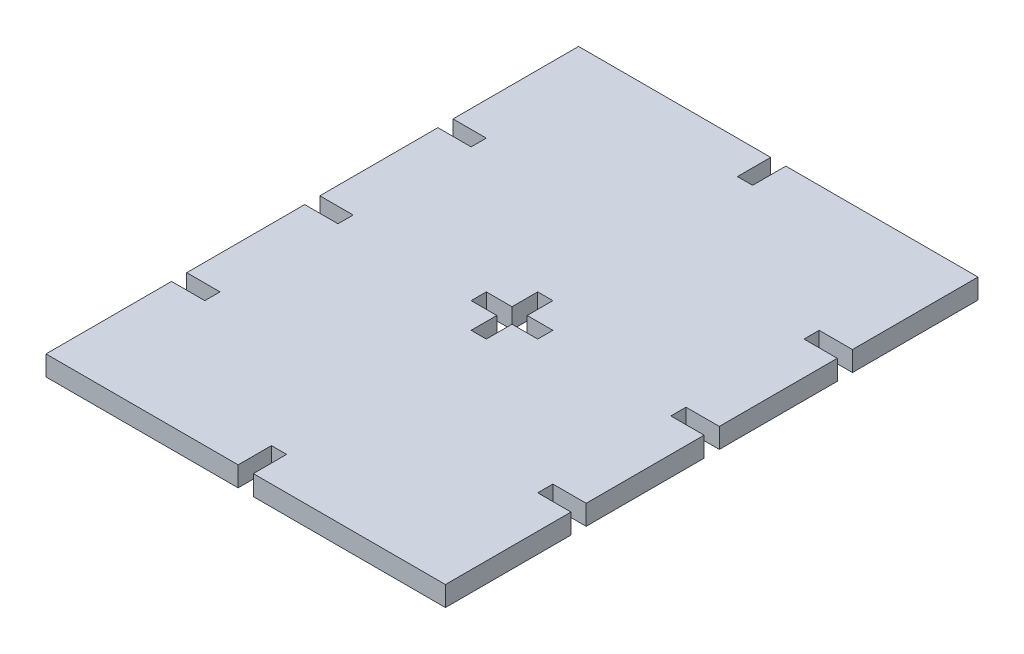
ISO-10303-21;
HEADER;
FILE_DESCRIPTION(('STEP AP214'),'2;1');
FILE_NAME('part.step','',(''),(''),'','','');
FILE_SCHEMA(('AUTOMOTIVE_DESIGN { 1 0 10303 214 1 1 1 1 }'));
ENDSEC;
DATA;
#1=APPLICATION_CONTEXT('core data for automotive mechanical design processes');
#2=APPLICATION_PROTOCOL_DEFINITION('international standard','automotive_design',2000,#1);
#3=PRODUCT_CONTEXT('',#1,'mechanical');
#4=PRODUCT('Part','Part','',(#3));
#5=PRODUCT_RELATED_PRODUCT_CATEGORY('part','',(#4));
#6=PRODUCT_DEFINITION_FORMATION('','',#4);
#7=PRODUCT_DEFINITION_CONTEXT('part definition',#1,'design');
#8=PRODUCT_DEFINITION('design','',#6,#7);
#9=PRODUCT_DEFINITION_SHAPE('','',#8);
#10=(LENGTH_UNIT() NAMED_UNIT(*) SI_UNIT(.MILLI.,.METRE.));
#11=(NAMED_UNIT(*) PLANE_ANGLE_UNIT() SI_UNIT($,.RADIAN.));
#12=(NAMED_UNIT(*) SI_UNIT($,.STERADIAN.) SOLID_ANGLE_UNIT());
#13=UNCERTAINTY_MEASURE_WITH_UNIT(LENGTH_MEASURE(1.E-05),#10,'distance_accuracy_value','');
#14=(GEOMETRIC_REPRESENTATION_CONTEXT(3) GLOBAL_UNCERTAINTY_ASSIGNED_CONTEXT((#13)) GLOBAL_UNIT_ASSIGNED_CONTEXT((#10,
#11,#12)) REPRESENTATION_CONTEXT('',''));
#15=CARTESIAN_POINT('',(0.,0.,0.));
#16=DIRECTION('',(0.,0.,1.));
#17=DIRECTION('',(1.,0.,0.));
#18=AXIS2_PLACEMENT_3D('',#15,#16,#17);
#19=CARTESIAN_POINT('',(30.,3.,40.));
#20=DIRECTION('',(-1.,0.,0.));
#21=DIRECTION('',(0.,0.,1.));
#22=AXIS2_PLACEMENT_3D('',#19,#20,#21);
#23=PLANE('',#22);
#24=DIRECTION('',(0.,1.,0.));
#25=VECTOR('',#24,1.);
#26=CARTESIAN_POINT('',(30.,3.,18.86));
#27=LINE('',#26,#25);
#28=CARTESIAN_POINT('',(30.,0.,18.86));
#29=VERTEX_POINT('',#28);
#30=CARTESIAN_POINT('',(30.,3.,18.86));
#31=VERTEX_POINT('',#30);
#32=EDGE_CURVE('E604',#29,#31,#27,.T.);
#33=ORIENTED_EDGE('',*,*,#32,.F.);
#34=DIRECTION('',(0.,0.,-1.));
#35=VECTOR('',#34,1.);
#36=CARTESIAN_POINT('',(30.,0.,40.));
#37=LINE('',#36,#35);
#38=CARTESIAN_POINT('',(30.,0.,1.14));
#39=VERTEX_POINT('',#38);
#40=EDGE_CURVE('E650',#29,#39,#37,.T.);
#41=ORIENTED_EDGE('',*,*,#40,.T.);
#42=DIRECTION('',(0.,1.,0.));
#43=VECTOR('',#42,1.);
#44=CARTESIAN_POINT('',(30.,3.,1.14));
#45=LINE('',#44,#43);
#46=CARTESIAN_POINT('',(30.,3.,1.14));
#47=VERTEX_POINT('',#46);
#48=EDGE_CURVE('E450',#39,#47,#45,.T.);
#49=ORIENTED_EDGE('',*,*,#48,.T.);
#50=DIRECTION('',(0.,0.,-1.));
#51=VECTOR('',#50,1.);
#52=CARTESIAN_POINT('',(30.,3.,40.));
#53=LINE('',#52,#51);
#54=EDGE_CURVE('E631',#31,#47,#53,.T.);
#55=ORIENTED_EDGE('',*,*,#54,.F.);
#56=EDGE_LOOP('',(#33,#41,#49,#55));
#57=FACE_BOUND('',#56,.T.);
#58=ADVANCED_FACE('F65',(#57),#23,.F.);
#59=DIRECTION('',(0.,1.,0.));
#60=VECTOR('',#59,1.);
#61=CARTESIAN_POINT('',(30.,3.,-21.14));
#62=LINE('',#61,#60);
#63=CARTESIAN_POINT('',(30.,0.,-21.14));
#64=VERTEX_POINT('',#63);
#65=CARTESIAN_POINT('',(30.,3.,-21.14));
#66=VERTEX_POINT('',#65);
#67=EDGE_CURVE('E594',#64,#66,#62,.T.);
#68=ORIENTED_EDGE('',*,*,#67,.F.);
#69=CARTESIAN_POINT('',(30.,0.,-40.));
#70=VERTEX_POINT('',#69);
#71=EDGE_CURVE('E626',#64,#70,#37,.T.);
#72=ORIENTED_EDGE('',*,*,#71,.T.);
#73=DIRECTION('',(0.,-1.,0.));
#74=VECTOR('',#73,1.);
#75=CARTESIAN_POINT('',(30.,3.,-40.));
#76=LINE('',#75,#74);
#77=CARTESIAN_POINT('',(30.,3.,-40.));
#78=VERTEX_POINT('',#77);
#79=EDGE_CURVE('E671',#78,#70,#76,.T.);
#80=ORIENTED_EDGE('',*,*,#79,.F.);
#81=EDGE_CURVE('E632',#66,#78,#53,.T.);
#82=ORIENTED_EDGE('',*,*,#81,.F.);
#83=EDGE_LOOP('',(#68,#72,#80,#82));
#84=FACE_BOUND('',#83,.T.);
#85=ADVANCED_FACE('F758',(#84),#23,.F.);
#86=CARTESIAN_POINT('',(30.,0.,-1.14));
#87=VERTEX_POINT('',#86);
#88=CARTESIAN_POINT('',(30.,0.,-18.86));
#89=VERTEX_POINT('',#88);
#90=EDGE_CURVE('E787',#87,#89,#37,.T.);
#91=ORIENTED_EDGE('',*,*,#90,.T.);
#92=DIRECTION('',(0.,1.,0.));
#93=VECTOR('',#92,1.);
#94=CARTESIAN_POINT('',(30.,3.,-18.86));
#95=LINE('',#94,#93);
#96=CARTESIAN_POINT('',(30.,3.,-18.86));
#97=VERTEX_POINT('',#96);
#98=EDGE_CURVE('E591',#89,#97,#95,.T.);
#99=ORIENTED_EDGE('',*,*,#98,.T.);
#100=CARTESIAN_POINT('',(30.,3.,-1.14));
#101=VERTEX_POINT('',#100);
#102=EDGE_CURVE('E805',#101,#97,#53,.T.);
#103=ORIENTED_EDGE('',*,*,#102,.F.);
#104=DIRECTION('',(0.,1.,0.));
#105=VECTOR('',#104,1.);
#106=CARTESIAN_POINT('',(30.,3.,-1.14));
#107=LINE('',#106,#105);
#108=EDGE_CURVE('E589',#87,#101,#107,.T.);
#109=ORIENTED_EDGE('',*,*,#108,.F.);
#110=EDGE_LOOP('',(#91,#99,#103,#109));
#111=FACE_BOUND('',#110,.T.);
#112=ADVANCED_FACE('F763',(#111),#23,.F.);
#113=CARTESIAN_POINT('',(-30.,3.,-40.));
#114=DIRECTION('',(0.,0.,1.));
#115=DIRECTION('',(1.,0.,0.));
#116=AXIS2_PLACEMENT_3D('',#113,#114,#115);
#117=PLANE('',#116);
#118=DIRECTION('',(0.,-1.,0.));
#119=VECTOR('',#118,1.);
#120=CARTESIAN_POINT('',(1.14,3.,-40.));
#121=LINE('',#120,#119);
#122=CARTESIAN_POINT('',(1.14,3.,-40.));
#123=VERTEX_POINT('',#122);
#124=CARTESIAN_POINT('',(1.14,0.,-40.));
#125=VERTEX_POINT('',#124);
#126=EDGE_CURVE('E621',#123,#125,#121,.T.);
#127=ORIENTED_EDGE('',*,*,#126,.F.);
#128=DIRECTION('',(-1.,0.,0.));
#129=VECTOR('',#128,1.);
#130=CARTESIAN_POINT('',(-30.,3.,-40.));
#131=LINE('',#130,#129);
#132=EDGE_CURVE('E633',#78,#123,#131,.T.);
#133=ORIENTED_EDGE('',*,*,#132,.F.);
#134=ORIENTED_EDGE('',*,*,#79,.T.);
#135=DIRECTION('',(-1.,0.,0.));
#136=VECTOR('',#135,1.);
#137=CARTESIAN_POINT('',(-30.,0.,-40.));
#138=LINE('',#137,#136);
#139=EDGE_CURVE('E651',#70,#125,#138,.T.);
#140=ORIENTED_EDGE('',*,*,#139,.T.);
#141=EDGE_LOOP('',(#127,#133,#134,#140));
#142=FACE_BOUND('',#141,.T.);
#143=ADVANCED_FACE('F775',(#142),#117,.F.);
#144=CARTESIAN_POINT('',(-30.,3.,40.));
#145=DIRECTION('',(1.,0.,0.));
#146=DIRECTION('',(0.,0.,-1.));
#147=AXIS2_PLACEMENT_3D('',#144,#145,#146);
#148=PLANE('',#147);
#149=DIRECTION('',(0.,1.,0.));
#150=VECTOR('',#149,1.);
#151=CARTESIAN_POINT('',(-30.,3.,1.14000000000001));
#152=LINE('',#151,#150);
#153=CARTESIAN_POINT('',(-30.,0.,1.14000000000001));
#154=VERTEX_POINT('',#153);
#155=CARTESIAN_POINT('',(-30.,3.,1.14000000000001));
#156=VERTEX_POINT('',#155);
#157=EDGE_CURVE('E614',#154,#156,#152,.T.);
#158=ORIENTED_EDGE('',*,*,#157,.F.);
#159=DIRECTION('',(0.,0.,1.));
#160=VECTOR('',#159,1.);
#161=CARTESIAN_POINT('',(-30.,0.,40.));
#162=LINE('',#161,#160);
#163=CARTESIAN_POINT('',(-30.,0.,18.86));
#164=VERTEX_POINT('',#163);
#165=EDGE_CURVE('E897',#154,#164,#162,.T.);
#166=ORIENTED_EDGE('',*,*,#165,.T.);
#167=DIRECTION('',(0.,1.,0.));
#168=VECTOR('',#167,1.);
#169=CARTESIAN_POINT('',(-30.,3.,18.86));
#170=LINE('',#169,#168);
#171=CARTESIAN_POINT('',(-30.,3.,18.86));
#172=VERTEX_POINT('',#171);
#173=EDGE_CURVE('E596',#164,#172,#170,.T.);
#174=ORIENTED_EDGE('',*,*,#173,.T.);
#175=DIRECTION('',(0.,0.,1.));
#176=VECTOR('',#175,1.);
#177=CARTESIAN_POINT('',(-30.,3.,40.));
#178=LINE('',#177,#176);
#179=EDGE_CURVE('E915',#156,#172,#178,.T.);
#180=ORIENTED_EDGE('',*,*,#179,.F.);
#181=EDGE_LOOP('',(#158,#166,#174,#180));
#182=FACE_BOUND('',#181,.T.);
#183=ADVANCED_FACE('F782',(#182),#148,.F.);
#184=CARTESIAN_POINT('',(-30.,0.,-18.86));
#185=VERTEX_POINT('',#184);
#186=CARTESIAN_POINT('',(-30.,0.,-1.14));
#187=VERTEX_POINT('',#186);
#188=EDGE_CURVE('E659',#185,#187,#162,.T.);
#189=ORIENTED_EDGE('',*,*,#188,.T.);
#190=DIRECTION('',(0.,1.,0.));
#191=VECTOR('',#190,1.);
#192=CARTESIAN_POINT('',(-30.,3.,-1.14));
#193=LINE('',#192,#191);
#194=CARTESIAN_POINT('',(-30.,3.,-1.13999999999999));
#195=VERTEX_POINT('',#194);
#196=EDGE_CURVE('E611',#187,#195,#193,.T.);
#197=ORIENTED_EDGE('',*,*,#196,.T.);
#198=CARTESIAN_POINT('',(-30.,3.,-18.86));
#199=VERTEX_POINT('',#198);
#200=EDGE_CURVE('E641',#199,#195,#178,.T.);
#201=ORIENTED_EDGE('',*,*,#200,.F.);
#202=DIRECTION('',(0.,1.,0.));
#203=VECTOR('',#202,1.);
#204=CARTESIAN_POINT('',(-30.,3.,-18.86));
#205=LINE('',#204,#203);
#206=EDGE_CURVE('E609',#185,#199,#205,.T.);
#207=ORIENTED_EDGE('',*,*,#206,.F.);
#208=EDGE_LOOP('',(#189,#197,#201,#207));
#209=FACE_BOUND('',#208,.T.);
#210=ADVANCED_FACE('F880',(#209),#148,.F.);
#211=DIRECTION('',(0.,1.,0.));
#212=VECTOR('',#211,1.);
#213=CARTESIAN_POINT('',(-30.,3.,21.14));
#214=LINE('',#213,#212);
#215=CARTESIAN_POINT('',(-30.,0.,21.14));
#216=VERTEX_POINT('',#215);
#217=CARTESIAN_POINT('',(-30.,3.,21.14));
#218=VERTEX_POINT('',#217);
#219=EDGE_CURVE('E599',#216,#218,#214,.T.);
#220=ORIENTED_EDGE('',*,*,#219,.F.);
#221=CARTESIAN_POINT('',(-30.,0.,40.));
#222=VERTEX_POINT('',#221);
#223=EDGE_CURVE('E654',#216,#222,#162,.T.);
#224=ORIENTED_EDGE('',*,*,#223,.T.);
#225=DIRECTION('',(0.,-1.,0.));
#226=VECTOR('',#225,1.);
#227=CARTESIAN_POINT('',(-30.,3.,40.));
#228=LINE('',#227,#226);
#229=CARTESIAN_POINT('',(-30.,3.,40.));
#230=VERTEX_POINT('',#229);
#231=EDGE_CURVE('E665',#230,#222,#228,.T.);
#232=ORIENTED_EDGE('',*,*,#231,.F.);
#233=EDGE_CURVE('E636',#218,#230,#178,.T.);
#234=ORIENTED_EDGE('',*,*,#233,.F.);
#235=EDGE_LOOP('',(#220,#224,#232,#234));
#236=FACE_BOUND('',#235,.T.);
#237=ADVANCED_FACE('F876',(#236),#148,.F.);
#238=CARTESIAN_POINT('',(-30.,3.,40.));
#239=DIRECTION('',(0.,0.,-1.));
#240=DIRECTION('',(-1.,0.,0.));
#241=AXIS2_PLACEMENT_3D('',#238,#239,#240);
#242=PLANE('',#241);
#243=DIRECTION('',(0.,-1.,0.));
#244=VECTOR('',#243,1.);
#245=CARTESIAN_POINT('',(-1.14,3.,40.));
#246=LINE('',#245,#244);
#247=CARTESIAN_POINT('',(-1.14,3.,40.));
#248=VERTEX_POINT('',#247);
#249=CARTESIAN_POINT('',(-1.14,0.,40.));
#250=VERTEX_POINT('',#249);
#251=EDGE_CURVE('E619',#248,#250,#246,.T.);
#252=ORIENTED_EDGE('',*,*,#251,.F.);
#253=DIRECTION('',(1.,0.,0.));
#254=VECTOR('',#253,1.);
#255=CARTESIAN_POINT('',(-30.,3.,40.));
#256=LINE('',#255,#254);
#257=EDGE_CURVE('E642',#230,#248,#256,.T.);
#258=ORIENTED_EDGE('',*,*,#257,.F.);
#259=ORIENTED_EDGE('',*,*,#231,.T.);
#260=DIRECTION('',(1.,0.,0.));
#261=VECTOR('',#260,1.);
#262=CARTESIAN_POINT('',(-30.,0.,40.));
#263=LINE('',#262,#261);
#264=EDGE_CURVE('E660',#222,#250,#263,.T.);
#265=ORIENTED_EDGE('',*,*,#264,.T.);
#266=EDGE_LOOP('',(#252,#258,#259,#265));
#267=FACE_BOUND('',#266,.T.);
#268=ADVANCED_FACE('F832',(#267),#242,.F.);
#269=CARTESIAN_POINT('',(0.,3.,0.));
#270=DIRECTION('',(0.,-1.,0.));
#271=DIRECTION('',(0.,0.,-1.));
#272=AXIS2_PLACEMENT_3D('',#269,#270,#271);
#273=PLANE('',#272);
#274=DIRECTION('',(0.,0.,1.));
#275=VECTOR('',#274,1.);
#276=CARTESIAN_POINT('',(1.14,3.,-5.));
#277=LINE('',#276,#275);
#278=CARTESIAN_POINT('',(1.14,3.,1.14));
#279=VERTEX_POINT('',#278);
#280=CARTESIAN_POINT('',(1.14,3.,5.));
#281=VERTEX_POINT('',#280);
#282=EDGE_CURVE('E390',#279,#281,#277,.T.);
#283=ORIENTED_EDGE('',*,*,#282,.T.);
#284=DIRECTION('',(1.,0.,0.));
#285=VECTOR('',#284,1.);
#286=CARTESIAN_POINT('',(-1.14,3.,5.));
#287=LINE('',#286,#285);
#288=CARTESIAN_POINT('',(-1.14,3.,5.));
#289=VERTEX_POINT('',#288);
#290=EDGE_CURVE('E389',#289,#281,#287,.T.);
#291=ORIENTED_EDGE('',*,*,#290,.F.);
#292=DIRECTION('',(0.,0.,1.));
#293=VECTOR('',#292,1.);
#294=CARTESIAN_POINT('',(-1.14,3.,-5.));
#295=LINE('',#294,#293);
#296=CARTESIAN_POINT('',(-1.14,3.,1.14));
#297=VERTEX_POINT('',#296);
#298=EDGE_CURVE('E405',#297,#289,#295,.T.);
#299=ORIENTED_EDGE('',*,*,#298,.F.);
#300=DIRECTION('',(1.,0.,0.));
#301=VECTOR('',#300,1.);
#302=CARTESIAN_POINT('',(-5.,3.,1.14));
#303=LINE('',#302,#301);
#304=CARTESIAN_POINT('',(-5.,3.,1.14));
#305=VERTEX_POINT('',#304);
#306=EDGE_CURVE('E420',#305,#297,#303,.T.);
#307=ORIENTED_EDGE('',*,*,#306,.F.);
#308=DIRECTION('',(0.,0.,-1.));
#309=VECTOR('',#308,1.);
#310=CARTESIAN_POINT('',(-5.,3.,1.14));
#311=LINE('',#310,#309);
#312=CARTESIAN_POINT('',(-5.,3.,-1.14));
#313=VERTEX_POINT('',#312);
#314=EDGE_CURVE('E412',#305,#313,#311,.T.);
#315=ORIENTED_EDGE('',*,*,#314,.T.);
#316=DIRECTION('',(1.,0.,0.));
#317=VECTOR('',#316,1.);
#318=CARTESIAN_POINT('',(-5.,3.,-1.14));
#319=LINE('',#318,#317);
#320=CARTESIAN_POINT('',(-1.14,3.,-1.14));
#321=VERTEX_POINT('',#320);
#322=EDGE_CURVE('E416',#313,#321,#319,.T.);
#323=ORIENTED_EDGE('',*,*,#322,.T.);
#324=CARTESIAN_POINT('',(-1.14,3.,-5.));
#325=VERTEX_POINT('',#324);
#326=EDGE_CURVE('E397',#325,#321,#295,.T.);
#327=ORIENTED_EDGE('',*,*,#326,.F.);
#328=DIRECTION('',(1.,0.,0.));
#329=VECTOR('',#328,1.);
#330=CARTESIAN_POINT('',(-1.14,3.,-5.));
#331=LINE('',#330,#329);
#332=CARTESIAN_POINT('',(1.14,3.,-5.));
#333=VERTEX_POINT('',#332);
#334=EDGE_CURVE('E375',#325,#333,#331,.T.);
#335=ORIENTED_EDGE('',*,*,#334,.T.);
#336=CARTESIAN_POINT('',(1.14,3.,-1.14));
#337=VERTEX_POINT('',#336);
#338=EDGE_CURVE('E385',#333,#337,#277,.T.);
#339=ORIENTED_EDGE('',*,*,#338,.T.);
#340=CARTESIAN_POINT('',(5.,3.,-1.14));
#341=VERTEX_POINT('',#340);
#342=EDGE_CURVE('E415',#337,#341,#319,.T.);
#343=ORIENTED_EDGE('',*,*,#342,.T.);
#344=DIRECTION('',(0.,0.,-1.));
#345=VECTOR('',#344,1.);
#346=CARTESIAN_POINT('',(5.,3.,1.14));
#347=LINE('',#346,#345);
#348=CARTESIAN_POINT('',(5.,3.,1.14));
#349=VERTEX_POINT('',#348);
#350=EDGE_CURVE('E80',#349,#341,#347,.T.);
#351=ORIENTED_EDGE('',*,*,#350,.F.);
#352=EDGE_CURVE('E419',#279,#349,#303,.T.);
#353=ORIENTED_EDGE('',*,*,#352,.F.);
#354=EDGE_LOOP('',(#283,#291,#299,#307,#315,#323,#327,#335,#339,#343,#351,#353));
#355=FACE_BOUND('',#354,.T.);
#356=DIRECTION('',(1.,0.,0.));
#357=VECTOR('',#356,1.);
#358=CARTESIAN_POINT('',(-1.14,3.,-35.));
#359=LINE('',#358,#357);
#360=CARTESIAN_POINT('',(-1.14,3.,-35.));
#361=VERTEX_POINT('',#360);
#362=CARTESIAN_POINT('',(1.14,3.,-35.));
#363=VERTEX_POINT('',#362);
#364=EDGE_CURVE('E442',#361,#363,#359,.T.);
#365=ORIENTED_EDGE('',*,*,#364,.F.);
#366=DIRECTION('',(0.,0.,1.));
#367=VECTOR('',#366,1.);
#368=CARTESIAN_POINT('',(-1.14,3.,-45.));
#369=LINE('',#368,#367);
#370=CARTESIAN_POINT('',(-1.14,3.,-40.));
#371=VERTEX_POINT('',#370);
#372=EDGE_CURVE('E440',#371,#361,#369,.T.);
#373=ORIENTED_EDGE('',*,*,#372,.F.);
#374=CARTESIAN_POINT('',(-30.,3.,-40.));
#375=VERTEX_POINT('',#374);
#376=EDGE_CURVE('E630',#371,#375,#131,.T.);
#377=ORIENTED_EDGE('',*,*,#376,.T.);
#378=CARTESIAN_POINT('',(-30.,3.,-21.14));
#379=VERTEX_POINT('',#378);
#380=EDGE_CURVE('E637',#375,#379,#178,.T.);
#381=ORIENTED_EDGE('',*,*,#380,.T.);
#382=DIRECTION('',(-1.,0.,0.));
#383=VECTOR('',#382,1.);
#384=CARTESIAN_POINT('',(-25.,3.,-21.14));
#385=LINE('',#384,#383);
#386=CARTESIAN_POINT('',(-25.,3.,-21.14));
#387=VERTEX_POINT('',#386);
#388=EDGE_CURVE('E460',#387,#379,#385,.T.);
#389=ORIENTED_EDGE('',*,*,#388,.F.);
#390=DIRECTION('',(0.,0.,1.));
#391=VECTOR('',#390,1.);
#392=CARTESIAN_POINT('',(-25.,3.,-21.14));
#393=LINE('',#392,#391);
#394=CARTESIAN_POINT('',(-25.,3.,-18.86));
#395=VERTEX_POINT('',#394);
#396=EDGE_CURVE('E466',#387,#395,#393,.T.);
#397=ORIENTED_EDGE('',*,*,#396,.T.);
#398=DIRECTION('',(-1.,0.,0.));
#399=VECTOR('',#398,1.);
#400=CARTESIAN_POINT('',(-25.,3.,-18.86));
#401=LINE('',#400,#399);
#402=EDGE_CURVE('E462',#395,#199,#401,.T.);
#403=ORIENTED_EDGE('',*,*,#402,.T.);
#404=ORIENTED_EDGE('',*,*,#200,.T.);
#405=DIRECTION('',(-1.,0.,0.));
#406=VECTOR('',#405,1.);
#407=CARTESIAN_POINT('',(-25.,3.,-1.13999999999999));
#408=LINE('',#407,#406);
#409=CARTESIAN_POINT('',(-25.,3.,-1.13999999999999));
#410=VERTEX_POINT('',#409);
#411=EDGE_CURVE('E482',#410,#195,#408,.T.);
#412=ORIENTED_EDGE('',*,*,#411,.F.);
#413=DIRECTION('',(0.,0.,1.));
#414=VECTOR('',#413,1.);
#415=CARTESIAN_POINT('',(-25.,3.,-1.13999999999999));
#416=LINE('',#415,#414);
#417=CARTESIAN_POINT('',(-25.,3.,1.14000000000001));
#418=VERTEX_POINT('',#417);
#419=EDGE_CURVE('E457',#410,#418,#416,.T.);
#420=ORIENTED_EDGE('',*,*,#419,.T.);
#421=DIRECTION('',(-1.,0.,0.));
#422=VECTOR('',#421,1.);
#423=CARTESIAN_POINT('',(-25.,3.,1.14000000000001));
#424=LINE('',#423,#422);
#425=EDGE_CURVE('E484',#418,#156,#424,.T.);
#426=ORIENTED_EDGE('',*,*,#425,.T.);
#427=ORIENTED_EDGE('',*,*,#179,.T.);
#428=DIRECTION('',(-1.,0.,0.));
#429=VECTOR('',#428,1.);
#430=CARTESIAN_POINT('',(-25.,3.,18.86));
#431=LINE('',#430,#429);
#432=CARTESIAN_POINT('',(-25.,3.,18.86));
#433=VERTEX_POINT('',#432);
#434=EDGE_CURVE('E558',#433,#172,#431,.T.);
#435=ORIENTED_EDGE('',*,*,#434,.F.);
#436=DIRECTION('',(0.,0.,-1.));
#437=VECTOR('',#436,1.);
#438=CARTESIAN_POINT('',(-25.,3.,21.14));
#439=LINE('',#438,#437);
#440=CARTESIAN_POINT('',(-25.,3.,21.14));
#441=VERTEX_POINT('',#440);
#442=EDGE_CURVE('E534',#441,#433,#439,.T.);
#443=ORIENTED_EDGE('',*,*,#442,.F.);
#444=DIRECTION('',(-1.,0.,0.));
#445=VECTOR('',#444,1.);
#446=CARTESIAN_POINT('',(-25.,3.,21.14));
#447=LINE('',#446,#445);
#448=EDGE_CURVE('E555',#441,#218,#447,.T.);
#449=ORIENTED_EDGE('',*,*,#448,.T.);
#450=ORIENTED_EDGE('',*,*,#233,.T.);
#451=ORIENTED_EDGE('',*,*,#257,.T.);
#452=DIRECTION('',(0.,0.,-1.));
#453=VECTOR('',#452,1.);
#454=CARTESIAN_POINT('',(-1.14,3.,45.));
#455=LINE('',#454,#453);
#456=CARTESIAN_POINT('',(-1.14,3.,35.));
#457=VERTEX_POINT('',#456);
#458=EDGE_CURVE('E500',#248,#457,#455,.T.);
#459=ORIENTED_EDGE('',*,*,#458,.T.);
#460=DIRECTION('',(1.,0.,0.));
#461=VECTOR('',#460,1.);
#462=CARTESIAN_POINT('',(-1.14,3.,35.));
#463=LINE('',#462,#461);
#464=CARTESIAN_POINT('',(1.14,3.,35.));
#465=VERTEX_POINT('',#464);
#466=EDGE_CURVE('E503',#457,#465,#463,.T.);
#467=ORIENTED_EDGE('',*,*,#466,.T.);
#468=DIRECTION('',(0.,0.,-1.));
#469=VECTOR('',#468,1.);
#470=CARTESIAN_POINT('',(1.14,3.,45.));
#471=LINE('',#470,#469);
#472=CARTESIAN_POINT('',(1.14,3.,40.));
#473=VERTEX_POINT('',#472);
#474=EDGE_CURVE('E479',#473,#465,#471,.T.);
#475=ORIENTED_EDGE('',*,*,#474,.F.);
#476=CARTESIAN_POINT('',(30.,3.,40.));
#477=VERTEX_POINT('',#476);
#478=EDGE_CURVE('E640',#473,#477,#256,.T.);
#479=ORIENTED_EDGE('',*,*,#478,.T.);
#480=CARTESIAN_POINT('',(30.,3.,21.14));
#481=VERTEX_POINT('',#480);
#482=EDGE_CURVE('E627',#477,#481,#53,.T.);
#483=ORIENTED_EDGE('',*,*,#482,.T.);
#484=DIRECTION('',(1.,0.,0.));
#485=VECTOR('',#484,1.);
#486=CARTESIAN_POINT('',(25.,3.,21.14));
#487=LINE('',#486,#485);
#488=CARTESIAN_POINT('',(25.,3.,21.14));
#489=VERTEX_POINT('',#488);
#490=EDGE_CURVE('E574',#489,#481,#487,.T.);
#491=ORIENTED_EDGE('',*,*,#490,.F.);
#492=DIRECTION('',(0.,0.,-1.));
#493=VECTOR('',#492,1.);
#494=CARTESIAN_POINT('',(25.,3.,21.14));
#495=LINE('',#494,#493);
#496=CARTESIAN_POINT('',(25.,3.,18.86));
#497=VERTEX_POINT('',#496);
#498=EDGE_CURVE('E554',#489,#497,#495,.T.);
#499=ORIENTED_EDGE('',*,*,#498,.T.);
#500=DIRECTION('',(1.,0.,0.));
#501=VECTOR('',#500,1.);
#502=CARTESIAN_POINT('',(25.,3.,18.86));
#503=LINE('',#502,#501);
#504=EDGE_CURVE('E576',#497,#31,#503,.T.);
#505=ORIENTED_EDGE('',*,*,#504,.T.);
#506=ORIENTED_EDGE('',*,*,#54,.T.);
#507=DIRECTION('',(1.,0.,0.));
#508=VECTOR('',#507,1.);
#509=CARTESIAN_POINT('',(25.,3.,1.14));
#510=LINE('',#509,#508);
#511=CARTESIAN_POINT('',(25.,3.,1.14));
#512=VERTEX_POINT('',#511);
#513=EDGE_CURVE('E518',#512,#47,#510,.T.);
#514=ORIENTED_EDGE('',*,*,#513,.F.);
#515=DIRECTION('',(0.,0.,1.));
#516=VECTOR('',#515,1.);
#517=CARTESIAN_POINT('',(25.,3.,-1.14));
#518=LINE('',#517,#516);
#519=CARTESIAN_POINT('',(25.,3.,-1.14));
#520=VERTEX_POINT('',#519);
#521=EDGE_CURVE('E443',#520,#512,#518,.T.);
#522=ORIENTED_EDGE('',*,*,#521,.F.);
#523=DIRECTION('',(1.,0.,0.));
#524=VECTOR('',#523,1.);
#525=CARTESIAN_POINT('',(25.,3.,-1.14));
#526=LINE('',#525,#524);
#527=EDGE_CURVE('E515',#520,#101,#526,.T.);
#528=ORIENTED_EDGE('',*,*,#527,.T.);
#529=ORIENTED_EDGE('',*,*,#102,.T.);
#530=DIRECTION('',(1.,0.,0.));
#531=VECTOR('',#530,1.);
#532=CARTESIAN_POINT('',(25.,3.,-18.86));
#533=LINE('',#532,#531);
#534=CARTESIAN_POINT('',(25.,3.,-18.86));
#535=VERTEX_POINT('',#534);
#536=EDGE_CURVE('E538',#535,#97,#533,.T.);
#537=ORIENTED_EDGE('',*,*,#536,.F.);
#538=DIRECTION('',(0.,0.,1.));
#539=VECTOR('',#538,1.);
#540=CARTESIAN_POINT('',(25.,3.,-21.14));
#541=LINE('',#540,#539);
#542=CARTESIAN_POINT('',(25.,3.,-21.14));
#543=VERTEX_POINT('',#542);
#544=EDGE_CURVE('E514',#543,#535,#541,.T.);
#545=ORIENTED_EDGE('',*,*,#544,.F.);
#546=DIRECTION('',(1.,0.,0.));
#547=VECTOR('',#546,1.);
#548=CARTESIAN_POINT('',(25.,3.,-21.14));
#549=LINE('',#548,#547);
#550=EDGE_CURVE('E535',#543,#66,#549,.T.);
#551=ORIENTED_EDGE('',*,*,#550,.T.);
#552=ORIENTED_EDGE('',*,*,#81,.T.);
#553=ORIENTED_EDGE('',*,*,#132,.T.);
#554=DIRECTION('',(0.,0.,1.));
#555=VECTOR('',#554,1.);
#556=CARTESIAN_POINT('',(1.14,3.,-45.));
#557=LINE('',#556,#555);
#558=EDGE_CURVE('E439',#123,#363,#557,.T.);
#559=ORIENTED_EDGE('',*,*,#558,.T.);
#560=EDGE_LOOP('',(#365,#373,#377,#381,#389,#397,#403,#404,#412,#420,#426,#427,#435,#443,#449,
#450,#451,#459,#467,#475,#479,#483,#491,#499,#505,#506,#514,#522,#528,#529,#537,#545,#551,#552,
#553,#559));
#561=FACE_BOUND('',#560,.T.);
#562=ADVANCED_FACE('F393',(#355,#561),#273,.F.);
#563=CARTESIAN_POINT('',(0.,0.,0.));
#564=DIRECTION('',(0.,-1.,0.));
#565=DIRECTION('',(0.,0.,-1.));
#566=AXIS2_PLACEMENT_3D('',#563,#564,#565);
#567=PLANE('',#566);
#568=DIRECTION('',(-1.,0.,0.));
#569=VECTOR('',#568,1.);
#570=CARTESIAN_POINT('',(0.,0.,5.));
#571=LINE('',#570,#569);
#572=CARTESIAN_POINT('',(1.14,0.,5.));
#573=VERTEX_POINT('',#572);
#574=CARTESIAN_POINT('',(-1.14,0.,5.));
#575=VERTEX_POINT('',#574);
#576=EDGE_CURVE('E12',#573,#575,#571,.T.);
#577=ORIENTED_EDGE('',*,*,#576,.F.);
#578=DIRECTION('',(0.,0.,-1.));
#579=VECTOR('',#578,1.);
#580=CARTESIAN_POINT('',(1.14,0.,0.));
#581=LINE('',#580,#579);
#582=CARTESIAN_POINT('',(1.14,0.,1.14));
#583=VERTEX_POINT('',#582);
#584=EDGE_CURVE('E704',#573,#583,#581,.T.);
#585=ORIENTED_EDGE('',*,*,#584,.T.);
#586=DIRECTION('',(-1.,0.,0.));
#587=VECTOR('',#586,1.);
#588=CARTESIAN_POINT('',(0.,0.,1.14));
#589=LINE('',#588,#587);
#590=CARTESIAN_POINT('',(5.,0.,1.14));
#591=VERTEX_POINT('',#590);
#592=EDGE_CURVE('E694',#591,#583,#589,.T.);
#593=ORIENTED_EDGE('',*,*,#592,.F.);
#594=DIRECTION('',(0.,0.,1.));
#595=VECTOR('',#594,1.);
#596=CARTESIAN_POINT('',(5.,0.,0.));
#597=LINE('',#596,#595);
#598=CARTESIAN_POINT('',(5.,0.,-1.14));
#599=VERTEX_POINT('',#598);
#600=EDGE_CURVE('E687',#599,#591,#597,.T.);
#601=ORIENTED_EDGE('',*,*,#600,.F.);
#602=DIRECTION('',(-1.,0.,0.));
#603=VECTOR('',#602,1.);
#604=CARTESIAN_POINT('',(0.,0.,-1.14));
#605=LINE('',#604,#603);
#606=CARTESIAN_POINT('',(1.14,0.,-1.14));
#607=VERTEX_POINT('',#606);
#608=EDGE_CURVE('E684',#599,#607,#605,.T.);
#609=ORIENTED_EDGE('',*,*,#608,.T.);
#610=DIRECTION('',(0.,0.,-1.));
#611=VECTOR('',#610,1.);
#612=CARTESIAN_POINT('',(1.14,0.,0.));
#613=LINE('',#612,#611);
#614=CARTESIAN_POINT('',(1.14,0.,-5.));
#615=VERTEX_POINT('',#614);
#616=EDGE_CURVE('E689',#607,#615,#613,.T.);
#617=ORIENTED_EDGE('',*,*,#616,.T.);
#618=DIRECTION('',(-1.,0.,0.));
#619=VECTOR('',#618,1.);
#620=CARTESIAN_POINT('',(0.,0.,-5.));
#621=LINE('',#620,#619);
#622=CARTESIAN_POINT('',(-1.14,0.,-5.));
#623=VERTEX_POINT('',#622);
#624=EDGE_CURVE('E378',#615,#623,#621,.T.);
#625=ORIENTED_EDGE('',*,*,#624,.T.);
#626=DIRECTION('',(0.,0.,-1.));
#627=VECTOR('',#626,1.);
#628=CARTESIAN_POINT('',(-1.14,0.,0.));
#629=LINE('',#628,#627);
#630=CARTESIAN_POINT('',(-1.14,0.,-1.14));
#631=VERTEX_POINT('',#630);
#632=EDGE_CURVE('E692',#631,#623,#629,.T.);
#633=ORIENTED_EDGE('',*,*,#632,.F.);
#634=DIRECTION('',(-1.,0.,0.));
#635=VECTOR('',#634,1.);
#636=CARTESIAN_POINT('',(0.,0.,-1.14));
#637=LINE('',#636,#635);
#638=CARTESIAN_POINT('',(-5.,0.,-1.14));
#639=VERTEX_POINT('',#638);
#640=EDGE_CURVE('E696',#631,#639,#637,.T.);
#641=ORIENTED_EDGE('',*,*,#640,.T.);
#642=DIRECTION('',(0.,0.,1.));
#643=VECTOR('',#642,1.);
#644=CARTESIAN_POINT('',(-5.,0.,0.));
#645=LINE('',#644,#643);
#646=CARTESIAN_POINT('',(-5.,0.,1.14));
#647=VERTEX_POINT('',#646);
#648=EDGE_CURVE('E699',#639,#647,#645,.T.);
#649=ORIENTED_EDGE('',*,*,#648,.T.);
#650=DIRECTION('',(-1.,0.,0.));
#651=VECTOR('',#650,1.);
#652=CARTESIAN_POINT('',(0.,0.,1.14));
#653=LINE('',#652,#651);
#654=CARTESIAN_POINT('',(-1.14,0.,1.14));
#655=VERTEX_POINT('',#654);
#656=EDGE_CURVE('E702',#655,#647,#653,.T.);
#657=ORIENTED_EDGE('',*,*,#656,.F.);
#658=DIRECTION('',(0.,0.,-1.));
#659=VECTOR('',#658,1.);
#660=CARTESIAN_POINT('',(-1.14,0.,0.));
#661=LINE('',#660,#659);
#662=EDGE_CURVE('E73',#575,#655,#661,.T.);
#663=ORIENTED_EDGE('',*,*,#662,.F.);
#664=EDGE_LOOP('',(#577,#585,#593,#601,#609,#617,#625,#633,#641,#649,#657,#663));
#665=FACE_BOUND('',#664,.T.);
#666=DIRECTION('',(0.,0.,-1.));
#667=VECTOR('',#666,1.);
#668=CARTESIAN_POINT('',(-1.14,0.,0.));
#669=LINE('',#668,#667);
#670=CARTESIAN_POINT('',(-1.14,0.,-35.));
#671=VERTEX_POINT('',#670);
#672=CARTESIAN_POINT('',(-1.14,0.,-40.));
#673=VERTEX_POINT('',#672);
#674=EDGE_CURVE('E682',#671,#673,#669,.T.);
#675=ORIENTED_EDGE('',*,*,#674,.F.);
#676=DIRECTION('',(1.,0.,0.));
#677=VECTOR('',#676,1.);
#678=CARTESIAN_POINT('',(-1.14,0.,-35.));
#679=LINE('',#678,#677);
#680=CARTESIAN_POINT('',(1.14,0.,-35.));
#681=VERTEX_POINT('',#680);
#682=EDGE_CURVE('E435',#671,#681,#679,.T.);
#683=ORIENTED_EDGE('',*,*,#682,.T.);
#684=DIRECTION('',(0.,0.,-1.));
#685=VECTOR('',#684,1.);
#686=CARTESIAN_POINT('',(1.14,0.,0.));
#687=LINE('',#686,#685);
#688=EDGE_CURVE('E679',#681,#125,#687,.T.);
#689=ORIENTED_EDGE('',*,*,#688,.T.);
#690=ORIENTED_EDGE('',*,*,#139,.F.);
#691=ORIENTED_EDGE('',*,*,#71,.F.);
#692=DIRECTION('',(1.,0.,0.));
#693=VECTOR('',#692,1.);
#694=CARTESIAN_POINT('',(25.,0.,-21.14));
#695=LINE('',#694,#693);
#696=CARTESIAN_POINT('',(25.,0.,-21.14));
#697=VERTEX_POINT('',#696);
#698=EDGE_CURVE('E531',#697,#64,#695,.T.);
#699=ORIENTED_EDGE('',*,*,#698,.F.);
#700=DIRECTION('',(0.,0.,1.));
#701=VECTOR('',#700,1.);
#702=CARTESIAN_POINT('',(25.,0.,-21.14));
#703=LINE('',#702,#701);
#704=CARTESIAN_POINT('',(25.,0.,-18.86));
#705=VERTEX_POINT('',#704);
#706=EDGE_CURVE('E539',#697,#705,#703,.T.);
#707=ORIENTED_EDGE('',*,*,#706,.T.);
#708=DIRECTION('',(1.,0.,0.));
#709=VECTOR('',#708,1.);
#710=CARTESIAN_POINT('',(25.,0.,-18.86));
#711=LINE('',#710,#709);
#712=EDGE_CURVE('E544',#705,#89,#711,.T.);
#713=ORIENTED_EDGE('',*,*,#712,.T.);
#714=ORIENTED_EDGE('',*,*,#90,.F.);
#715=DIRECTION('',(1.,0.,0.));
#716=VECTOR('',#715,1.);
#717=CARTESIAN_POINT('',(25.,0.,-1.14));
#718=LINE('',#717,#716);
#719=CARTESIAN_POINT('',(25.,0.,-1.14));
#720=VERTEX_POINT('',#719);
#721=EDGE_CURVE('E511',#720,#87,#718,.T.);
#722=ORIENTED_EDGE('',*,*,#721,.F.);
#723=DIRECTION('',(0.,0.,1.));
#724=VECTOR('',#723,1.);
#725=CARTESIAN_POINT('',(25.,0.,-1.14));
#726=LINE('',#725,#724);
#727=CARTESIAN_POINT('',(25.,0.,1.14));
#728=VERTEX_POINT('',#727);
#729=EDGE_CURVE('E519',#720,#728,#726,.T.);
#730=ORIENTED_EDGE('',*,*,#729,.T.);
#731=DIRECTION('',(1.,0.,0.));
#732=VECTOR('',#731,1.);
#733=CARTESIAN_POINT('',(25.,0.,1.14));
#734=LINE('',#733,#732);
#735=EDGE_CURVE('E524',#728,#39,#734,.T.);
#736=ORIENTED_EDGE('',*,*,#735,.T.);
#737=ORIENTED_EDGE('',*,*,#40,.F.);
#738=DIRECTION('',(1.,0.,0.));
#739=VECTOR('',#738,1.);
#740=CARTESIAN_POINT('',(25.,0.,18.86));
#741=LINE('',#740,#739);
#742=CARTESIAN_POINT('',(25.,0.,18.86));
#743=VERTEX_POINT('',#742);
#744=EDGE_CURVE('E584',#743,#29,#741,.T.);
#745=ORIENTED_EDGE('',*,*,#744,.F.);
#746=DIRECTION('',(0.,0.,-1.));
#747=VECTOR('',#746,1.);
#748=CARTESIAN_POINT('',(25.,0.,21.14));
#749=LINE('',#748,#747);
#750=CARTESIAN_POINT('',(25.,0.,21.14));
#751=VERTEX_POINT('',#750);
#752=EDGE_CURVE('E577',#751,#743,#749,.T.);
#753=ORIENTED_EDGE('',*,*,#752,.F.);
#754=DIRECTION('',(1.,0.,0.));
#755=VECTOR('',#754,1.);
#756=CARTESIAN_POINT('',(25.,0.,21.14));
#757=LINE('',#756,#755);
#758=CARTESIAN_POINT('',(30.,0.,21.14));
#759=VERTEX_POINT('',#758);
#760=EDGE_CURVE('E573',#751,#759,#757,.T.);
#761=ORIENTED_EDGE('',*,*,#760,.T.);
#762=CARTESIAN_POINT('',(30.,0.,40.));
#763=VERTEX_POINT('',#762);
#764=EDGE_CURVE('E646',#763,#759,#37,.T.);
#765=ORIENTED_EDGE('',*,*,#764,.F.);
#766=CARTESIAN_POINT('',(1.14,0.,40.));
#767=VERTEX_POINT('',#766);
#768=EDGE_CURVE('E658',#767,#763,#263,.T.);
#769=ORIENTED_EDGE('',*,*,#768,.F.);
#770=DIRECTION('',(0.,0.,1.));
#771=VECTOR('',#770,1.);
#772=CARTESIAN_POINT('',(1.14,0.,0.));
#773=LINE('',#772,#771);
#774=CARTESIAN_POINT('',(1.14,0.,35.));
#775=VERTEX_POINT('',#774);
#776=EDGE_CURVE('E674',#775,#767,#773,.T.);
#777=ORIENTED_EDGE('',*,*,#776,.F.);
#778=DIRECTION('',(1.,0.,0.));
#779=VECTOR('',#778,1.);
#780=CARTESIAN_POINT('',(-1.14,0.,35.));
#781=LINE('',#780,#779);
#782=CARTESIAN_POINT('',(-1.14,0.,35.));
#783=VERTEX_POINT('',#782);
#784=EDGE_CURVE('E498',#783,#775,#781,.T.);
#785=ORIENTED_EDGE('',*,*,#784,.F.);
#786=DIRECTION('',(0.,0.,1.));
#787=VECTOR('',#786,1.);
#788=CARTESIAN_POINT('',(-1.14,0.,0.));
#789=LINE('',#788,#787);
#790=EDGE_CURVE('E676',#783,#250,#789,.T.);
#791=ORIENTED_EDGE('',*,*,#790,.T.);
#792=ORIENTED_EDGE('',*,*,#264,.F.);
#793=ORIENTED_EDGE('',*,*,#223,.F.);
#794=DIRECTION('',(-1.,0.,0.));
#795=VECTOR('',#794,1.);
#796=CARTESIAN_POINT('',(-25.,0.,21.14));
#797=LINE('',#796,#795);
#798=CARTESIAN_POINT('',(-25.,0.,21.14));
#799=VERTEX_POINT('',#798);
#800=EDGE_CURVE('E551',#799,#216,#797,.T.);
#801=ORIENTED_EDGE('',*,*,#800,.F.);
#802=DIRECTION('',(0.,0.,-1.));
#803=VECTOR('',#802,1.);
#804=CARTESIAN_POINT('',(-25.,0.,21.14));
#805=LINE('',#804,#803);
#806=CARTESIAN_POINT('',(-25.,0.,18.86));
#807=VERTEX_POINT('',#806);
#808=EDGE_CURVE('E559',#799,#807,#805,.T.);
#809=ORIENTED_EDGE('',*,*,#808,.T.);
#810=DIRECTION('',(-1.,0.,0.));
#811=VECTOR('',#810,1.);
#812=CARTESIAN_POINT('',(-25.,0.,18.86));
#813=LINE('',#812,#811);
#814=EDGE_CURVE('E564',#807,#164,#813,.T.);
#815=ORIENTED_EDGE('',*,*,#814,.T.);
#816=ORIENTED_EDGE('',*,*,#165,.F.);
#817=DIRECTION('',(-1.,0.,0.));
#818=VECTOR('',#817,1.);
#819=CARTESIAN_POINT('',(-25.,0.,1.14000000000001));
#820=LINE('',#819,#818);
#821=CARTESIAN_POINT('',(-25.,0.,1.14000000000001));
#822=VERTEX_POINT('',#821);
#823=EDGE_CURVE('E492',#822,#154,#820,.T.);
#824=ORIENTED_EDGE('',*,*,#823,.F.);
#825=DIRECTION('',(0.,0.,1.));
#826=VECTOR('',#825,1.);
#827=CARTESIAN_POINT('',(-25.,0.,-1.13999999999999));
#828=LINE('',#827,#826);
#829=CARTESIAN_POINT('',(-25.,0.,-1.13999999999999));
#830=VERTEX_POINT('',#829);
#831=EDGE_CURVE('E485',#830,#822,#828,.T.);
#832=ORIENTED_EDGE('',*,*,#831,.F.);
#833=DIRECTION('',(-1.,0.,0.));
#834=VECTOR('',#833,1.);
#835=CARTESIAN_POINT('',(-25.,0.,-1.13999999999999));
#836=LINE('',#835,#834);
#837=EDGE_CURVE('E481',#830,#187,#836,.T.);
#838=ORIENTED_EDGE('',*,*,#837,.T.);
#839=ORIENTED_EDGE('',*,*,#188,.F.);
#840=DIRECTION('',(-1.,0.,0.));
#841=VECTOR('',#840,1.);
#842=CARTESIAN_POINT('',(-25.,0.,-18.86));
#843=LINE('',#842,#841);
#844=CARTESIAN_POINT('',(-25.,0.,-18.86));
#845=VERTEX_POINT('',#844);
#846=EDGE_CURVE('E472',#845,#185,#843,.T.);
#847=ORIENTED_EDGE('',*,*,#846,.F.);
#848=DIRECTION('',(0.,0.,1.));
#849=VECTOR('',#848,1.);
#850=CARTESIAN_POINT('',(-25.,0.,-21.14));
#851=LINE('',#850,#849);
#852=CARTESIAN_POINT('',(-25.,0.,-21.14));
#853=VERTEX_POINT('',#852);
#854=EDGE_CURVE('E463',#853,#845,#851,.T.);
#855=ORIENTED_EDGE('',*,*,#854,.F.);
#856=DIRECTION('',(-1.,0.,0.));
#857=VECTOR('',#856,1.);
#858=CARTESIAN_POINT('',(-25.,0.,-21.14));
#859=LINE('',#858,#857);
#860=CARTESIAN_POINT('',(-30.,0.,-21.14));
#861=VERTEX_POINT('',#860);
#862=EDGE_CURVE('E459',#853,#861,#859,.T.);
#863=ORIENTED_EDGE('',*,*,#862,.T.);
#864=CARTESIAN_POINT('',(-30.,0.,-40.));
#865=VERTEX_POINT('',#864);
#866=EDGE_CURVE('E655',#865,#861,#162,.T.);
#867=ORIENTED_EDGE('',*,*,#866,.F.);
#868=EDGE_CURVE('E649',#673,#865,#138,.T.);
#869=ORIENTED_EDGE('',*,*,#868,.F.);
#870=EDGE_LOOP('',(#675,#683,#689,#690,#691,#699,#707,#713,#714,#722,#730,#736,#737,#745,#753,
#761,#765,#769,#777,#785,#791,#792,#793,#801,#809,#815,#816,#824,#832,#838,#839,#847,#855,#863,
#867,#869));
#871=FACE_BOUND('',#870,.T.);
#872=ADVANCED_FACE('F720',(#665,#871),#567,.T.);
#873=ORIENTED_EDGE('',*,*,#764,.T.);
#874=DIRECTION('',(0.,1.,0.));
#875=VECTOR('',#874,1.);
#876=CARTESIAN_POINT('',(30.,3.,21.14));
#877=LINE('',#876,#875);
#878=EDGE_CURVE('E601',#759,#481,#877,.T.);
#879=ORIENTED_EDGE('',*,*,#878,.T.);
#880=ORIENTED_EDGE('',*,*,#482,.F.);
#881=DIRECTION('',(0.,-1.,0.));
#882=VECTOR('',#881,1.);
#883=CARTESIAN_POINT('',(30.,3.,40.));
#884=LINE('',#883,#882);
#885=EDGE_CURVE('E645',#477,#763,#884,.T.);
#886=ORIENTED_EDGE('',*,*,#885,.T.);
#887=EDGE_LOOP('',(#873,#879,#880,#886));
#888=FACE_BOUND('',#887,.T.);
#889=ADVANCED_FACE('F67',(#888),#23,.F.);
#890=ORIENTED_EDGE('',*,*,#376,.F.);
#891=DIRECTION('',(0.,-1.,0.));
#892=VECTOR('',#891,1.);
#893=CARTESIAN_POINT('',(-1.14,3.,-40.));
#894=LINE('',#893,#892);
#895=EDGE_CURVE('E623',#371,#673,#894,.T.);
#896=ORIENTED_EDGE('',*,*,#895,.T.);
#897=ORIENTED_EDGE('',*,*,#868,.T.);
#898=DIRECTION('',(0.,-1.,0.));
#899=VECTOR('',#898,1.);
#900=CARTESIAN_POINT('',(-30.,3.,-40.));
#901=LINE('',#900,#899);
#902=EDGE_CURVE('E668',#375,#865,#901,.T.);
#903=ORIENTED_EDGE('',*,*,#902,.F.);
#904=EDGE_LOOP('',(#890,#896,#897,#903));
#905=FACE_BOUND('',#904,.T.);
#906=ADVANCED_FACE('F767',(#905),#117,.F.);
#907=ORIENTED_EDGE('',*,*,#866,.T.);
#908=DIRECTION('',(0.,1.,0.));
#909=VECTOR('',#908,1.);
#910=CARTESIAN_POINT('',(-30.,3.,-21.14));
#911=LINE('',#910,#909);
#912=EDGE_CURVE('E606',#861,#379,#911,.T.);
#913=ORIENTED_EDGE('',*,*,#912,.T.);
#914=ORIENTED_EDGE('',*,*,#380,.F.);
#915=ORIENTED_EDGE('',*,*,#902,.T.);
#916=EDGE_LOOP('',(#907,#913,#914,#915));
#917=FACE_BOUND('',#916,.T.);
#918=ADVANCED_FACE('F773',(#917),#148,.F.);
#919=ORIENTED_EDGE('',*,*,#478,.F.);
#920=DIRECTION('',(0.,-1.,0.));
#921=VECTOR('',#920,1.);
#922=CARTESIAN_POINT('',(1.14,3.,40.));
#923=LINE('',#922,#921);
#924=EDGE_CURVE('E616',#473,#767,#923,.T.);
#925=ORIENTED_EDGE('',*,*,#924,.T.);
#926=ORIENTED_EDGE('',*,*,#768,.T.);
#927=ORIENTED_EDGE('',*,*,#885,.F.);
#928=EDGE_LOOP('',(#919,#925,#926,#927));
#929=FACE_BOUND('',#928,.T.);
#930=ADVANCED_FACE('F823',(#929),#242,.F.);
#931=CARTESIAN_POINT('',(25.,0.,-1.14));
#932=DIRECTION('',(0.,0.,1.));
#933=DIRECTION('',(1.,0.,0.));
#934=AXIS2_PLACEMENT_3D('',#931,#932,#933);
#935=PLANE('',#934);
#936=ORIENTED_EDGE('',*,*,#108,.T.);
#937=ORIENTED_EDGE('',*,*,#527,.F.);
#938=DIRECTION('',(0.,1.,0.));
#939=VECTOR('',#938,1.);
#940=CARTESIAN_POINT('',(25.,0.,-1.14));
#941=LINE('',#940,#939);
#942=EDGE_CURVE('E512',#720,#520,#941,.T.);
#943=ORIENTED_EDGE('',*,*,#942,.F.);
#944=ORIENTED_EDGE('',*,*,#721,.T.);
#945=EDGE_LOOP('',(#936,#937,#943,#944));
#946=FACE_BOUND('',#945,.T.);
#947=ADVANCED_FACE('F821',(#946),#935,.T.);
#948=CARTESIAN_POINT('',(25.,0.,1.14));
#949=DIRECTION('',(0.,0.,1.));
#950=DIRECTION('',(1.,0.,0.));
#951=AXIS2_PLACEMENT_3D('',#948,#949,#950);
#952=PLANE('',#951);
#953=ORIENTED_EDGE('',*,*,#735,.F.);
#954=DIRECTION('',(0.,1.,0.));
#955=VECTOR('',#954,1.);
#956=CARTESIAN_POINT('',(25.,0.,1.14));
#957=LINE('',#956,#955);
#958=EDGE_CURVE('E509',#728,#512,#957,.T.);
#959=ORIENTED_EDGE('',*,*,#958,.T.);
#960=ORIENTED_EDGE('',*,*,#513,.T.);
#961=ORIENTED_EDGE('',*,*,#48,.F.);
#962=EDGE_LOOP('',(#953,#959,#960,#961));
#963=FACE_BOUND('',#962,.T.);
#964=ADVANCED_FACE('F814',(#963),#952,.F.);
#965=CARTESIAN_POINT('',(25.,0.,-1.14));
#966=DIRECTION('',(-1.,0.,0.));
#967=DIRECTION('',(0.,0.,1.));
#968=AXIS2_PLACEMENT_3D('',#965,#966,#967);
#969=PLANE('',#968);
#970=ORIENTED_EDGE('',*,*,#521,.T.);
#971=ORIENTED_EDGE('',*,*,#958,.F.);
#972=ORIENTED_EDGE('',*,*,#729,.F.);
#973=ORIENTED_EDGE('',*,*,#942,.T.);
#974=EDGE_LOOP('',(#970,#971,#972,#973));
#975=FACE_BOUND('',#974,.T.);
#976=ADVANCED_FACE('F818',(#975),#969,.F.);
#977=CARTESIAN_POINT('',(25.,0.,-21.14));
#978=DIRECTION('',(0.,0.,1.));
#979=DIRECTION('',(1.,0.,0.));
#980=AXIS2_PLACEMENT_3D('',#977,#978,#979);
#981=PLANE('',#980);
#982=ORIENTED_EDGE('',*,*,#67,.T.);
#983=ORIENTED_EDGE('',*,*,#550,.F.);
#984=DIRECTION('',(0.,1.,0.));
#985=VECTOR('',#984,1.);
#986=CARTESIAN_POINT('',(25.,0.,-21.14));
#987=LINE('',#986,#985);
#988=EDGE_CURVE('E532',#697,#543,#987,.T.);
#989=ORIENTED_EDGE('',*,*,#988,.F.);
#990=ORIENTED_EDGE('',*,*,#698,.T.);
#991=EDGE_LOOP('',(#982,#983,#989,#990));
#992=FACE_BOUND('',#991,.T.);
#993=ADVANCED_FACE('F843',(#992),#981,.T.);
#994=CARTESIAN_POINT('',(25.,0.,-18.86));
#995=DIRECTION('',(0.,0.,1.));
#996=DIRECTION('',(1.,0.,0.));
#997=AXIS2_PLACEMENT_3D('',#994,#995,#996);
#998=PLANE('',#997);
#999=ORIENTED_EDGE('',*,*,#712,.F.);
#1000=DIRECTION('',(0.,1.,0.));
#1001=VECTOR('',#1000,1.);
#1002=CARTESIAN_POINT('',(25.,0.,-18.86));
#1003=LINE('',#1002,#1001);
#1004=EDGE_CURVE('E529',#705,#535,#1003,.T.);
#1005=ORIENTED_EDGE('',*,*,#1004,.T.);
#1006=ORIENTED_EDGE('',*,*,#536,.T.);
#1007=ORIENTED_EDGE('',*,*,#98,.F.);
#1008=EDGE_LOOP('',(#999,#1005,#1006,#1007));
#1009=FACE_BOUND('',#1008,.T.);
#1010=ADVANCED_FACE('F839',(#1009),#998,.F.);
#1011=CARTESIAN_POINT('',(25.,0.,-21.14));
#1012=DIRECTION('',(-1.,0.,0.));
#1013=DIRECTION('',(0.,0.,1.));
#1014=AXIS2_PLACEMENT_3D('',#1011,#1012,#1013);
#1015=PLANE('',#1014);
#1016=ORIENTED_EDGE('',*,*,#544,.T.);
#1017=ORIENTED_EDGE('',*,*,#1004,.F.);
#1018=ORIENTED_EDGE('',*,*,#706,.F.);
#1019=ORIENTED_EDGE('',*,*,#988,.T.);
#1020=EDGE_LOOP('',(#1016,#1017,#1018,#1019));
#1021=FACE_BOUND('',#1020,.T.);
#1022=ADVANCED_FACE('F835',(#1021),#1015,.F.);
#1023=CARTESIAN_POINT('',(-25.,0.,21.14));
#1024=DIRECTION('',(0.,0.,-1.));
#1025=DIRECTION('',(-1.,0.,0.));
#1026=AXIS2_PLACEMENT_3D('',#1023,#1024,#1025);
#1027=PLANE('',#1026);
#1028=ORIENTED_EDGE('',*,*,#219,.T.);
#1029=ORIENTED_EDGE('',*,*,#448,.F.);
#1030=DIRECTION('',(0.,1.,0.));
#1031=VECTOR('',#1030,1.);
#1032=CARTESIAN_POINT('',(-25.,0.,21.14));
#1033=LINE('',#1032,#1031);
#1034=EDGE_CURVE('E552',#799,#441,#1033,.T.);
#1035=ORIENTED_EDGE('',*,*,#1034,.F.);
#1036=ORIENTED_EDGE('',*,*,#800,.T.);
#1037=EDGE_LOOP('',(#1028,#1029,#1035,#1036));
#1038=FACE_BOUND('',#1037,.T.);
#1039=ADVANCED_FACE('F838',(#1038),#1027,.T.);
#1040=CARTESIAN_POINT('',(-25.,0.,18.86));
#1041=DIRECTION('',(0.,0.,-1.));
#1042=DIRECTION('',(-1.,0.,0.));
#1043=AXIS2_PLACEMENT_3D('',#1040,#1041,#1042);
#1044=PLANE('',#1043);
#1045=ORIENTED_EDGE('',*,*,#814,.F.);
#1046=DIRECTION('',(0.,1.,0.));
#1047=VECTOR('',#1046,1.);
#1048=CARTESIAN_POINT('',(-25.,0.,18.86));
#1049=LINE('',#1048,#1047);
#1050=EDGE_CURVE('E549',#807,#433,#1049,.T.);
#1051=ORIENTED_EDGE('',*,*,#1050,.T.);
#1052=ORIENTED_EDGE('',*,*,#434,.T.);
#1053=ORIENTED_EDGE('',*,*,#173,.F.);
#1054=EDGE_LOOP('',(#1045,#1051,#1052,#1053));
#1055=FACE_BOUND('',#1054,.T.);
#1056=ADVANCED_FACE('F852',(#1055),#1044,.F.);
#1057=CARTESIAN_POINT('',(-25.,0.,21.14));
#1058=DIRECTION('',(1.,0.,0.));
#1059=DIRECTION('',(0.,0.,-1.));
#1060=AXIS2_PLACEMENT_3D('',#1057,#1058,#1059);
#1061=PLANE('',#1060);
#1062=ORIENTED_EDGE('',*,*,#442,.T.);
#1063=ORIENTED_EDGE('',*,*,#1050,.F.);
#1064=ORIENTED_EDGE('',*,*,#808,.F.);
#1065=ORIENTED_EDGE('',*,*,#1034,.T.);
#1066=EDGE_LOOP('',(#1062,#1063,#1064,#1065));
#1067=FACE_BOUND('',#1066,.T.);
#1068=ADVANCED_FACE('F848',(#1067),#1061,.F.);
#1069=CARTESIAN_POINT('',(25.,0.,18.86));
#1070=DIRECTION('',(0.,0.,1.));
#1071=DIRECTION('',(1.,0.,0.));
#1072=AXIS2_PLACEMENT_3D('',#1069,#1070,#1071);
#1073=PLANE('',#1072);
#1074=ORIENTED_EDGE('',*,*,#32,.T.);
#1075=ORIENTED_EDGE('',*,*,#504,.F.);
#1076=DIRECTION('',(0.,1.,0.));
#1077=VECTOR('',#1076,1.);
#1078=CARTESIAN_POINT('',(25.,0.,18.86));
#1079=LINE('',#1078,#1077);
#1080=EDGE_CURVE('E469',#743,#497,#1079,.T.);
#1081=ORIENTED_EDGE('',*,*,#1080,.F.);
#1082=ORIENTED_EDGE('',*,*,#744,.T.);
#1083=EDGE_LOOP('',(#1074,#1075,#1081,#1082));
#1084=FACE_BOUND('',#1083,.T.);
#1085=ADVANCED_FACE('F851',(#1084),#1073,.T.);
#1086=CARTESIAN_POINT('',(25.,0.,21.14));
#1087=DIRECTION('',(0.,0.,1.));
#1088=DIRECTION('',(1.,0.,0.));
#1089=AXIS2_PLACEMENT_3D('',#1086,#1087,#1088);
#1090=PLANE('',#1089);
#1091=ORIENTED_EDGE('',*,*,#760,.F.);
#1092=DIRECTION('',(0.,1.,0.));
#1093=VECTOR('',#1092,1.);
#1094=CARTESIAN_POINT('',(25.,0.,21.14));
#1095=LINE('',#1094,#1093);
#1096=EDGE_CURVE('E571',#751,#489,#1095,.T.);
#1097=ORIENTED_EDGE('',*,*,#1096,.T.);
#1098=ORIENTED_EDGE('',*,*,#490,.T.);
#1099=ORIENTED_EDGE('',*,*,#878,.F.);
#1100=EDGE_LOOP('',(#1091,#1097,#1098,#1099));
#1101=FACE_BOUND('',#1100,.T.);
#1102=ADVANCED_FACE('F864',(#1101),#1090,.F.);
#1103=CARTESIAN_POINT('',(25.,0.,21.14));
#1104=DIRECTION('',(1.,0.,0.));
#1105=DIRECTION('',(0.,0.,-1.));
#1106=AXIS2_PLACEMENT_3D('',#1103,#1104,#1105);
#1107=PLANE('',#1106);
#1108=ORIENTED_EDGE('',*,*,#498,.F.);
#1109=ORIENTED_EDGE('',*,*,#1096,.F.);
#1110=ORIENTED_EDGE('',*,*,#752,.T.);
#1111=ORIENTED_EDGE('',*,*,#1080,.T.);
#1112=EDGE_LOOP('',(#1108,#1109,#1110,#1111));
#1113=FACE_BOUND('',#1112,.T.);
#1114=ADVANCED_FACE('F860',(#1113),#1107,.T.);
#1115=CARTESIAN_POINT('',(-25.,0.,-18.86));
#1116=DIRECTION('',(0.,0.,-1.));
#1117=DIRECTION('',(-1.,0.,0.));
#1118=AXIS2_PLACEMENT_3D('',#1115,#1116,#1117);
#1119=PLANE('',#1118);
#1120=ORIENTED_EDGE('',*,*,#206,.T.);
#1121=ORIENTED_EDGE('',*,*,#402,.F.);
#1122=DIRECTION('',(0.,1.,0.));
#1123=VECTOR('',#1122,1.);
#1124=CARTESIAN_POINT('',(-25.,0.,-18.86));
#1125=LINE('',#1124,#1123);
#1126=EDGE_CURVE('E453',#845,#395,#1125,.T.);
#1127=ORIENTED_EDGE('',*,*,#1126,.F.);
#1128=ORIENTED_EDGE('',*,*,#846,.T.);
#1129=EDGE_LOOP('',(#1120,#1121,#1127,#1128));
#1130=FACE_BOUND('',#1129,.T.);
#1131=ADVANCED_FACE('F863',(#1130),#1119,.T.);
#1132=CARTESIAN_POINT('',(-25.,0.,-21.14));
#1133=DIRECTION('',(0.,0.,-1.));
#1134=DIRECTION('',(-1.,0.,0.));
#1135=AXIS2_PLACEMENT_3D('',#1132,#1133,#1134);
#1136=PLANE('',#1135);
#1137=ORIENTED_EDGE('',*,*,#862,.F.);
#1138=DIRECTION('',(0.,1.,0.));
#1139=VECTOR('',#1138,1.);
#1140=CARTESIAN_POINT('',(-25.,0.,-21.14));
#1141=LINE('',#1140,#1139);
#1142=EDGE_CURVE('E456',#853,#387,#1141,.T.);
#1143=ORIENTED_EDGE('',*,*,#1142,.T.);
#1144=ORIENTED_EDGE('',*,*,#388,.T.);
#1145=ORIENTED_EDGE('',*,*,#912,.F.);
#1146=EDGE_LOOP('',(#1137,#1143,#1144,#1145));
#1147=FACE_BOUND('',#1146,.T.);
#1148=ADVANCED_FACE('F1002',(#1147),#1136,.F.);
#1149=CARTESIAN_POINT('',(-25.,0.,-21.14));
#1150=DIRECTION('',(-1.,0.,0.));
#1151=DIRECTION('',(0.,0.,1.));
#1152=AXIS2_PLACEMENT_3D('',#1149,#1150,#1151);
#1153=PLANE('',#1152);
#1154=ORIENTED_EDGE('',*,*,#396,.F.);
#1155=ORIENTED_EDGE('',*,*,#1142,.F.);
#1156=ORIENTED_EDGE('',*,*,#854,.T.);
#1157=ORIENTED_EDGE('',*,*,#1126,.T.);
#1158=EDGE_LOOP('',(#1154,#1155,#1156,#1157));
#1159=FACE_BOUND('',#1158,.T.);
#1160=ADVANCED_FACE('F1010',(#1159),#1153,.T.);
#1161=CARTESIAN_POINT('',(-25.,0.,1.14000000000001));
#1162=DIRECTION('',(0.,0.,-1.));
#1163=DIRECTION('',(-1.,0.,0.));
#1164=AXIS2_PLACEMENT_3D('',#1161,#1162,#1163);
#1165=PLANE('',#1164);
#1166=ORIENTED_EDGE('',*,*,#157,.T.);
#1167=ORIENTED_EDGE('',*,*,#425,.F.);
#1168=DIRECTION('',(0.,1.,0.));
#1169=VECTOR('',#1168,1.);
#1170=CARTESIAN_POINT('',(-25.,0.,1.14000000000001));
#1171=LINE('',#1170,#1169);
#1172=EDGE_CURVE('E475',#822,#418,#1171,.T.);
#1173=ORIENTED_EDGE('',*,*,#1172,.F.);
#1174=ORIENTED_EDGE('',*,*,#823,.T.);
#1175=EDGE_LOOP('',(#1166,#1167,#1173,#1174));
#1176=FACE_BOUND('',#1175,.T.);
#1177=ADVANCED_FACE('F1018',(#1176),#1165,.T.);
#1178=CARTESIAN_POINT('',(-25.,0.,-1.13999999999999));
#1179=DIRECTION('',(0.,0.,-1.));
#1180=DIRECTION('',(-1.,0.,0.));
#1181=AXIS2_PLACEMENT_3D('',#1178,#1179,#1180);
#1182=PLANE('',#1181);
#1183=ORIENTED_EDGE('',*,*,#837,.F.);
#1184=DIRECTION('',(0.,1.,0.));
#1185=VECTOR('',#1184,1.);
#1186=CARTESIAN_POINT('',(-25.,0.,-1.13999999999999));
#1187=LINE('',#1186,#1185);
#1188=EDGE_CURVE('E478',#830,#410,#1187,.T.);
#1189=ORIENTED_EDGE('',*,*,#1188,.T.);
#1190=ORIENTED_EDGE('',*,*,#411,.T.);
#1191=ORIENTED_EDGE('',*,*,#196,.F.);
#1192=EDGE_LOOP('',(#1183,#1189,#1190,#1191));
#1193=FACE_BOUND('',#1192,.T.);
#1194=ADVANCED_FACE('F912',(#1193),#1182,.F.);
#1195=CARTESIAN_POINT('',(-25.,0.,-1.13999999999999));
#1196=DIRECTION('',(-1.,0.,0.));
#1197=DIRECTION('',(0.,0.,1.));
#1198=AXIS2_PLACEMENT_3D('',#1195,#1196,#1197);
#1199=PLANE('',#1198);
#1200=ORIENTED_EDGE('',*,*,#419,.F.);
#1201=ORIENTED_EDGE('',*,*,#1188,.F.);
#1202=ORIENTED_EDGE('',*,*,#831,.T.);
#1203=ORIENTED_EDGE('',*,*,#1172,.T.);
#1204=EDGE_LOOP('',(#1200,#1201,#1202,#1203));
#1205=FACE_BOUND('',#1204,.T.);
#1206=ADVANCED_FACE('F951',(#1205),#1199,.T.);
#1207=CARTESIAN_POINT('',(-1.14,0.,45.));
#1208=DIRECTION('',(1.,0.,0.));
#1209=DIRECTION('',(0.,0.,-1.));
#1210=AXIS2_PLACEMENT_3D('',#1207,#1208,#1209);
#1211=PLANE('',#1210);
#1212=ORIENTED_EDGE('',*,*,#251,.T.);
#1213=ORIENTED_EDGE('',*,*,#790,.F.);
#1214=DIRECTION('',(0.,1.,0.));
#1215=VECTOR('',#1214,1.);
#1216=CARTESIAN_POINT('',(-1.14,0.,35.));
#1217=LINE('',#1216,#1215);
#1218=EDGE_CURVE('E434',#783,#457,#1217,.T.);
#1219=ORIENTED_EDGE('',*,*,#1218,.T.);
#1220=ORIENTED_EDGE('',*,*,#458,.F.);
#1221=EDGE_LOOP('',(#1212,#1213,#1219,#1220));
#1222=FACE_BOUND('',#1221,.T.);
#1223=ADVANCED_FACE('F923',(#1222),#1211,.T.);
#1224=CARTESIAN_POINT('',(1.14,0.,45.));
#1225=DIRECTION('',(1.,0.,0.));
#1226=DIRECTION('',(0.,0.,-1.));
#1227=AXIS2_PLACEMENT_3D('',#1224,#1225,#1226);
#1228=PLANE('',#1227);
#1229=ORIENTED_EDGE('',*,*,#474,.T.);
#1230=DIRECTION('',(0.,1.,0.));
#1231=VECTOR('',#1230,1.);
#1232=CARTESIAN_POINT('',(1.14,0.,35.));
#1233=LINE('',#1232,#1231);
#1234=EDGE_CURVE('E495',#775,#465,#1233,.T.);
#1235=ORIENTED_EDGE('',*,*,#1234,.F.);
#1236=ORIENTED_EDGE('',*,*,#776,.T.);
#1237=ORIENTED_EDGE('',*,*,#924,.F.);
#1238=EDGE_LOOP('',(#1229,#1235,#1236,#1237));
#1239=FACE_BOUND('',#1238,.T.);
#1240=ADVANCED_FACE('F942',(#1239),#1228,.F.);
#1241=CARTESIAN_POINT('',(-1.14,0.,35.));
#1242=DIRECTION('',(0.,0.,1.));
#1243=DIRECTION('',(1.,0.,0.));
#1244=AXIS2_PLACEMENT_3D('',#1241,#1242,#1243);
#1245=PLANE('',#1244);
#1246=ORIENTED_EDGE('',*,*,#466,.F.);
#1247=ORIENTED_EDGE('',*,*,#1218,.F.);
#1248=ORIENTED_EDGE('',*,*,#784,.T.);
#1249=ORIENTED_EDGE('',*,*,#1234,.T.);
#1250=EDGE_LOOP('',(#1246,#1247,#1248,#1249));
#1251=FACE_BOUND('',#1250,.T.);
#1252=ADVANCED_FACE('F930',(#1251),#1245,.T.);
#1253=CARTESIAN_POINT('',(-1.14,0.,-45.));
#1254=DIRECTION('',(-1.,0.,0.));
#1255=DIRECTION('',(0.,0.,1.));
#1256=AXIS2_PLACEMENT_3D('',#1253,#1254,#1255);
#1257=PLANE('',#1256);
#1258=ORIENTED_EDGE('',*,*,#372,.T.);
#1259=DIRECTION('',(0.,1.,0.));
#1260=VECTOR('',#1259,1.);
#1261=CARTESIAN_POINT('',(-1.14,0.,-35.));
#1262=LINE('',#1261,#1260);
#1263=EDGE_CURVE('E438',#671,#361,#1262,.T.);
#1264=ORIENTED_EDGE('',*,*,#1263,.F.);
#1265=ORIENTED_EDGE('',*,*,#674,.T.);
#1266=ORIENTED_EDGE('',*,*,#895,.F.);
#1267=EDGE_LOOP('',(#1258,#1264,#1265,#1266));
#1268=FACE_BOUND('',#1267,.T.);
#1269=ADVANCED_FACE('F949',(#1268),#1257,.F.);
#1270=CARTESIAN_POINT('',(1.14,0.,-45.));
#1271=DIRECTION('',(-1.,0.,0.));
#1272=DIRECTION('',(0.,0.,1.));
#1273=AXIS2_PLACEMENT_3D('',#1270,#1271,#1272);
#1274=PLANE('',#1273);
#1275=ORIENTED_EDGE('',*,*,#126,.T.);
#1276=ORIENTED_EDGE('',*,*,#688,.F.);
#1277=DIRECTION('',(0.,1.,0.));
#1278=VECTOR('',#1277,1.);
#1279=CARTESIAN_POINT('',(1.14,0.,-35.));
#1280=LINE('',#1279,#1278);
#1281=EDGE_CURVE('E448',#681,#363,#1280,.T.);
#1282=ORIENTED_EDGE('',*,*,#1281,.T.);
#1283=ORIENTED_EDGE('',*,*,#558,.F.);
#1284=EDGE_LOOP('',(#1275,#1276,#1282,#1283));
#1285=FACE_BOUND('',#1284,.T.);
#1286=ADVANCED_FACE('F1064',(#1285),#1274,.T.);
#1287=CARTESIAN_POINT('',(-1.14,0.,-35.));
#1288=DIRECTION('',(0.,0.,1.));
#1289=DIRECTION('',(1.,0.,0.));
#1290=AXIS2_PLACEMENT_3D('',#1287,#1288,#1289);
#1291=PLANE('',#1290);
#1292=ORIENTED_EDGE('',*,*,#364,.T.);
#1293=ORIENTED_EDGE('',*,*,#1281,.F.);
#1294=ORIENTED_EDGE('',*,*,#682,.F.);
#1295=ORIENTED_EDGE('',*,*,#1263,.T.);
#1296=EDGE_LOOP('',(#1292,#1293,#1294,#1295));
#1297=FACE_BOUND('',#1296,.T.);
#1298=ADVANCED_FACE('F1075',(#1297),#1291,.F.);
#1299=CARTESIAN_POINT('',(-1.14,-7.,5.));
#1300=DIRECTION('',(0.,0.,1.));
#1301=DIRECTION('',(1.,0.,0.));
#1302=AXIS2_PLACEMENT_3D('',#1299,#1300,#1301);
#1303=PLANE('',#1302);
#1304=ORIENTED_EDGE('',*,*,#576,.T.);
#1305=DIRECTION('',(0.,1.,0.));
#1306=VECTOR('',#1305,1.);
#1307=CARTESIAN_POINT('',(-1.14,-7.,5.));
#1308=LINE('',#1307,#1306);
#1309=EDGE_CURVE('E409',#575,#289,#1308,.T.);
#1310=ORIENTED_EDGE('',*,*,#1309,.T.);
#1311=ORIENTED_EDGE('',*,*,#290,.T.);
#1312=DIRECTION('',(0.,1.,0.));
#1313=VECTOR('',#1312,1.);
#1314=CARTESIAN_POINT('',(1.14,-7.,5.));
#1315=LINE('',#1314,#1313);
#1316=EDGE_CURVE('E382',#573,#281,#1315,.T.);
#1317=ORIENTED_EDGE('',*,*,#1316,.F.);
#1318=EDGE_LOOP('',(#1304,#1310,#1311,#1317));
#1319=FACE_BOUND('',#1318,.T.);
#1320=ADVANCED_FACE('F736',(#1319),#1303,.F.);
#1321=CARTESIAN_POINT('',(-1.14,-7.,-5.));
#1322=DIRECTION('',(-1.,0.,0.));
#1323=DIRECTION('',(0.,0.,1.));
#1324=AXIS2_PLACEMENT_3D('',#1321,#1322,#1323);
#1325=PLANE('',#1324);
#1326=ORIENTED_EDGE('',*,*,#662,.T.);
#1327=DIRECTION('',(0.,1.,0.));
#1328=VECTOR('',#1327,1.);
#1329=CARTESIAN_POINT('',(-1.14,-7.,1.14));
#1330=LINE('',#1329,#1328);
#1331=EDGE_CURVE('E381',#655,#297,#1330,.T.);
#1332=ORIENTED_EDGE('',*,*,#1331,.T.);
#1333=ORIENTED_EDGE('',*,*,#298,.T.);
#1334=ORIENTED_EDGE('',*,*,#1309,.F.);
#1335=EDGE_LOOP('',(#1326,#1332,#1333,#1334));
#1336=FACE_BOUND('',#1335,.T.);
#1337=ADVANCED_FACE('F710',(#1336),#1325,.F.);
#1338=CARTESIAN_POINT('',(1.14,-7.,-5.));
#1339=DIRECTION('',(-1.,0.,0.));
#1340=DIRECTION('',(0.,0.,1.));
#1341=AXIS2_PLACEMENT_3D('',#1338,#1339,#1340);
#1342=PLANE('',#1341);
#1343=ORIENTED_EDGE('',*,*,#1316,.T.);
#1344=ORIENTED_EDGE('',*,*,#282,.F.);
#1345=DIRECTION('',(0.,1.,0.));
#1346=VECTOR('',#1345,1.);
#1347=CARTESIAN_POINT('',(1.14,-7.,1.14));
#1348=LINE('',#1347,#1346);
#1349=EDGE_CURVE('E430',#583,#279,#1348,.T.);
#1350=ORIENTED_EDGE('',*,*,#1349,.F.);
#1351=ORIENTED_EDGE('',*,*,#584,.F.);
#1352=EDGE_LOOP('',(#1343,#1344,#1350,#1351));
#1353=FACE_BOUND('',#1352,.T.);
#1354=ADVANCED_FACE('F741',(#1353),#1342,.T.);
#1355=ORIENTED_EDGE('',*,*,#632,.T.);
#1356=DIRECTION('',(0.,1.,0.));
#1357=VECTOR('',#1356,1.);
#1358=CARTESIAN_POINT('',(-1.14,-7.,-5.));
#1359=LINE('',#1358,#1357);
#1360=EDGE_CURVE('E407',#623,#325,#1359,.T.);
#1361=ORIENTED_EDGE('',*,*,#1360,.T.);
#1362=ORIENTED_EDGE('',*,*,#326,.T.);
#1363=DIRECTION('',(0.,1.,0.));
#1364=VECTOR('',#1363,1.);
#1365=CARTESIAN_POINT('',(-1.14,-7.,-1.14));
#1366=LINE('',#1365,#1364);
#1367=EDGE_CURVE('E429',#631,#321,#1366,.T.);
#1368=ORIENTED_EDGE('',*,*,#1367,.F.);
#1369=EDGE_LOOP('',(#1355,#1361,#1362,#1368));
#1370=FACE_BOUND('',#1369,.T.);
#1371=ADVANCED_FACE('F1120',(#1370),#1325,.F.);
#1372=CARTESIAN_POINT('',(-1.14,-7.,-5.));
#1373=DIRECTION('',(0.,0.,1.));
#1374=DIRECTION('',(1.,0.,0.));
#1375=AXIS2_PLACEMENT_3D('',#1372,#1373,#1374);
#1376=PLANE('',#1375);
#1377=DIRECTION('',(0.,1.,0.));
#1378=VECTOR('',#1377,1.);
#1379=CARTESIAN_POINT('',(1.14,-7.,-5.));
#1380=LINE('',#1379,#1378);
#1381=EDGE_CURVE('E370',#615,#333,#1380,.T.);
#1382=ORIENTED_EDGE('',*,*,#1381,.T.);
#1383=ORIENTED_EDGE('',*,*,#334,.F.);
#1384=ORIENTED_EDGE('',*,*,#1360,.F.);
#1385=ORIENTED_EDGE('',*,*,#624,.F.);
#1386=EDGE_LOOP('',(#1382,#1383,#1384,#1385));
#1387=FACE_BOUND('',#1386,.T.);
#1388=ADVANCED_FACE('F372',(#1387),#1376,.T.);
#1389=DIRECTION('',(0.,1.,0.));
#1390=VECTOR('',#1389,1.);
#1391=CARTESIAN_POINT('',(1.14,-7.,-1.14));
#1392=LINE('',#1391,#1390);
#1393=EDGE_CURVE('E88',#607,#337,#1392,.T.);
#1394=ORIENTED_EDGE('',*,*,#1393,.T.);
#1395=ORIENTED_EDGE('',*,*,#338,.F.);
#1396=ORIENTED_EDGE('',*,*,#1381,.F.);
#1397=ORIENTED_EDGE('',*,*,#616,.F.);
#1398=EDGE_LOOP('',(#1394,#1395,#1396,#1397));
#1399=FACE_BOUND('',#1398,.T.);
#1400=ADVANCED_FACE('F386',(#1399),#1342,.T.);
#1401=CARTESIAN_POINT('',(-5.,-7.,1.14));
#1402=DIRECTION('',(0.,0.,1.));
#1403=DIRECTION('',(1.,0.,0.));
#1404=AXIS2_PLACEMENT_3D('',#1401,#1402,#1403);
#1405=PLANE('',#1404);
#1406=ORIENTED_EDGE('',*,*,#656,.T.);
#1407=DIRECTION('',(0.,1.,0.));
#1408=VECTOR('',#1407,1.);
#1409=CARTESIAN_POINT('',(-5.,-7.,1.14));
#1410=LINE('',#1409,#1408);
#1411=EDGE_CURVE('E423',#647,#305,#1410,.T.);
#1412=ORIENTED_EDGE('',*,*,#1411,.T.);
#1413=ORIENTED_EDGE('',*,*,#306,.T.);
#1414=ORIENTED_EDGE('',*,*,#1331,.F.);
#1415=EDGE_LOOP('',(#1406,#1412,#1413,#1414));
#1416=FACE_BOUND('',#1415,.T.);
#1417=ADVANCED_FACE('F716',(#1416),#1405,.F.);
#1418=CARTESIAN_POINT('',(-5.,-7.,1.14));
#1419=DIRECTION('',(1.,0.,0.));
#1420=DIRECTION('',(0.,0.,-1.));
#1421=AXIS2_PLACEMENT_3D('',#1418,#1419,#1420);
#1422=PLANE('',#1421);
#1423=DIRECTION('',(0.,1.,0.));
#1424=VECTOR('',#1423,1.);
#1425=CARTESIAN_POINT('',(-5.,-7.,-1.14));
#1426=LINE('',#1425,#1424);
#1427=EDGE_CURVE('E398',#639,#313,#1426,.T.);
#1428=ORIENTED_EDGE('',*,*,#1427,.T.);
#1429=ORIENTED_EDGE('',*,*,#314,.F.);
#1430=ORIENTED_EDGE('',*,*,#1411,.F.);
#1431=ORIENTED_EDGE('',*,*,#648,.F.);
#1432=EDGE_LOOP('',(#1428,#1429,#1430,#1431));
#1433=FACE_BOUND('',#1432,.T.);
#1434=ADVANCED_FACE('F725',(#1433),#1422,.T.);
#1435=CARTESIAN_POINT('',(-5.,-7.,-1.14));
#1436=DIRECTION('',(0.,0.,1.));
#1437=DIRECTION('',(1.,0.,0.));
#1438=AXIS2_PLACEMENT_3D('',#1435,#1436,#1437);
#1439=PLANE('',#1438);
#1440=ORIENTED_EDGE('',*,*,#1367,.T.);
#1441=ORIENTED_EDGE('',*,*,#322,.F.);
#1442=ORIENTED_EDGE('',*,*,#1427,.F.);
#1443=ORIENTED_EDGE('',*,*,#640,.F.);
#1444=EDGE_LOOP('',(#1440,#1441,#1442,#1443));
#1445=FACE_BOUND('',#1444,.T.);
#1446=ADVANCED_FACE('F729',(#1445),#1439,.T.);
#1447=CARTESIAN_POINT('',(5.,-7.,1.14));
#1448=DIRECTION('',(1.,0.,0.));
#1449=DIRECTION('',(0.,0.,-1.));
#1450=AXIS2_PLACEMENT_3D('',#1447,#1448,#1449);
#1451=PLANE('',#1450);
#1452=ORIENTED_EDGE('',*,*,#600,.T.);
#1453=DIRECTION('',(0.,1.,0.));
#1454=VECTOR('',#1453,1.);
#1455=CARTESIAN_POINT('',(5.,-7.,1.14));
#1456=LINE('',#1455,#1454);
#1457=EDGE_CURVE('E425',#591,#349,#1456,.T.);
#1458=ORIENTED_EDGE('',*,*,#1457,.T.);
#1459=ORIENTED_EDGE('',*,*,#350,.T.);
#1460=DIRECTION('',(0.,1.,0.));
#1461=VECTOR('',#1460,1.);
#1462=CARTESIAN_POINT('',(5.,-7.,-1.14));
#1463=LINE('',#1462,#1461);
#1464=EDGE_CURVE('E400',#599,#341,#1463,.T.);
#1465=ORIENTED_EDGE('',*,*,#1464,.F.);
#1466=EDGE_LOOP('',(#1452,#1458,#1459,#1465));
#1467=FACE_BOUND('',#1466,.T.);
#1468=ADVANCED_FACE('F746',(#1467),#1451,.F.);
#1469=ORIENTED_EDGE('',*,*,#592,.T.);
#1470=ORIENTED_EDGE('',*,*,#1349,.T.);
#1471=ORIENTED_EDGE('',*,*,#352,.T.);
#1472=ORIENTED_EDGE('',*,*,#1457,.F.);
#1473=EDGE_LOOP('',(#1469,#1470,#1471,#1472));
#1474=FACE_BOUND('',#1473,.T.);
#1475=ADVANCED_FACE('F744',(#1474),#1405,.F.);
#1476=ORIENTED_EDGE('',*,*,#1464,.T.);
#1477=ORIENTED_EDGE('',*,*,#342,.F.);
#1478=ORIENTED_EDGE('',*,*,#1393,.F.);
#1479=ORIENTED_EDGE('',*,*,#608,.F.);
#1480=EDGE_LOOP('',(#1476,#1477,#1478,#1479));
#1481=FACE_BOUND('',#1480,.T.);
#1482=ADVANCED_FACE('F747',(#1481),#1439,.T.);
#1483=CLOSED_SHELL('',(#58,#85,#112,#143,#183,#210,#237,#268,#562,#872,#889,#906,#918,#930,#947,
#964,#976,#993,#1010,#1022,#1039,#1056,#1068,#1085,#1102,#1114,#1131,#1148,#1160,#1177,#1194,
#1206,#1223,#1240,#1252,#1269,#1286,#1298,#1320,#1337,#1354,#1371,#1388,#1400,#1417,#1434,#1446,
#1468,#1475,#1482));
#1484=MANIFOLD_SOLID_BREP('B2',#1483);
#1485=ADVANCED_BREP_SHAPE_REPRESENTATION('',(#18,#1484),#14);
#1486=SHAPE_DEFINITION_REPRESENTATION(#9,#1485);
ENDSEC;
END-ISO-10303-21;
